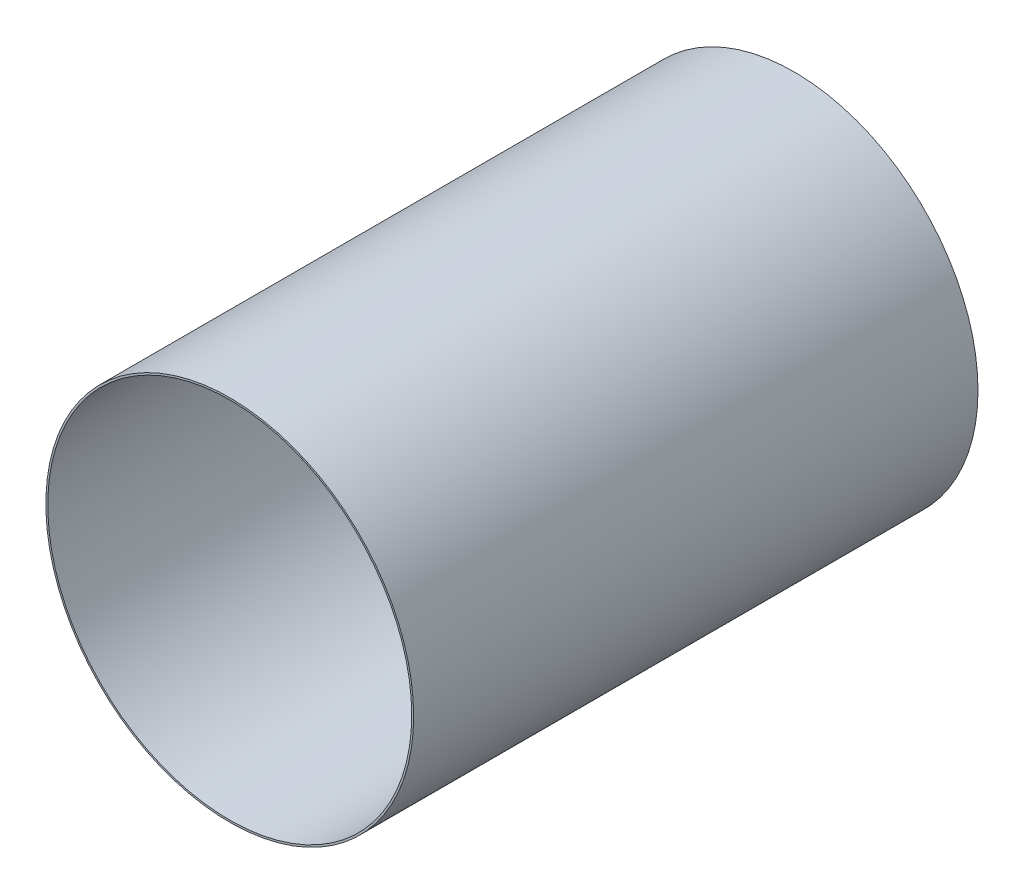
from build123d import *

# Parameters (mm, degrees)
SKIZZE1_R               = 290
LINEAR_AUSTRAGEN1_DEPTH = 890
WANDUNG1_T              = -3


with BuildPart() as part:
    # Skizze1 → Linear austragen1 (new body)
    with BuildSketch(Plane.XY):
        Circle(SKIZZE1_R)
    extrude(amount=LINEAR_AUSTRAGEN1_DEPTH)

    # Wandung1
    wandung1_openings = [part.faces().sort_by_distance(p)[0] for p in [
        (0, 0, 890),
    ]]
    offset(amount=WANDUNG1_T, openings=wandung1_openings, kind=Kind.INTERSECTION)


solid = part.part
